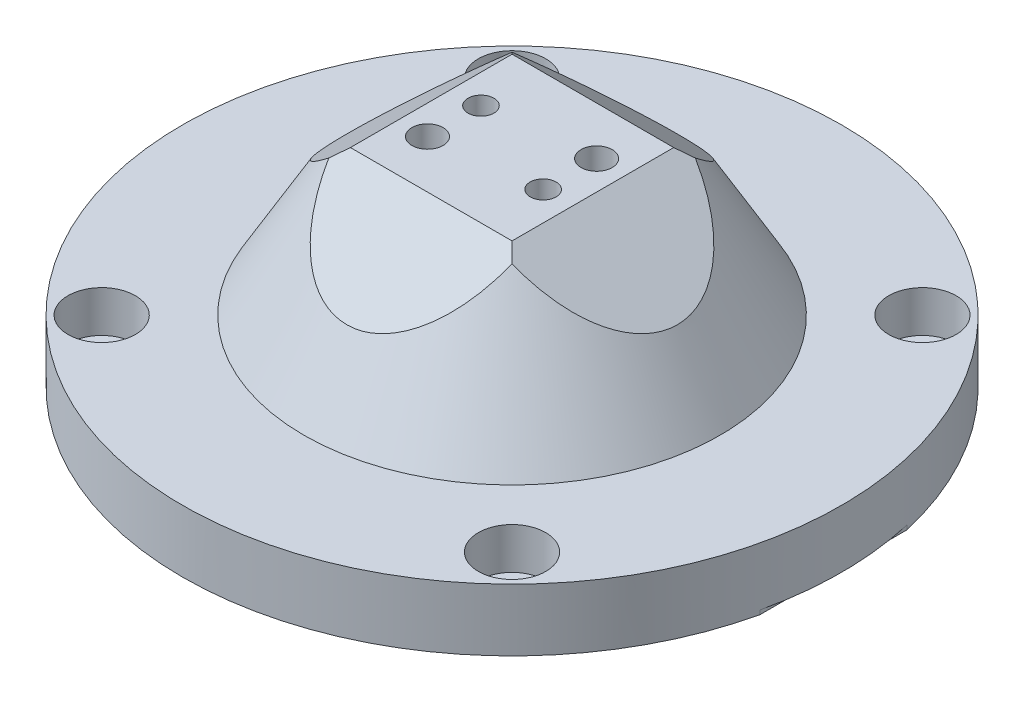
ISO-10303-21;
HEADER;
FILE_DESCRIPTION(('STEP AP214'),'2;1');
FILE_NAME('part.step','',(''),(''),'','','');
FILE_SCHEMA(('AUTOMOTIVE_DESIGN { 1 0 10303 214 1 1 1 1 }'));
ENDSEC;
DATA;
#1=APPLICATION_CONTEXT('core data for automotive mechanical design processes');
#2=APPLICATION_PROTOCOL_DEFINITION('international standard','automotive_design',2000,#1);
#3=PRODUCT_CONTEXT('',#1,'mechanical');
#4=PRODUCT('Part','Part','',(#3));
#5=PRODUCT_RELATED_PRODUCT_CATEGORY('part','',(#4));
#6=PRODUCT_DEFINITION_FORMATION('','',#4);
#7=PRODUCT_DEFINITION_CONTEXT('part definition',#1,'design');
#8=PRODUCT_DEFINITION('design','',#6,#7);
#9=PRODUCT_DEFINITION_SHAPE('','',#8);
#10=(LENGTH_UNIT() NAMED_UNIT(*) SI_UNIT(.MILLI.,.METRE.));
#11=(NAMED_UNIT(*) PLANE_ANGLE_UNIT() SI_UNIT($,.RADIAN.));
#12=(NAMED_UNIT(*) SI_UNIT($,.STERADIAN.) SOLID_ANGLE_UNIT());
#13=UNCERTAINTY_MEASURE_WITH_UNIT(LENGTH_MEASURE(1.E-05),#10,'distance_accuracy_value','');
#14=(GEOMETRIC_REPRESENTATION_CONTEXT(3) GLOBAL_UNCERTAINTY_ASSIGNED_CONTEXT((#13)) GLOBAL_UNIT_ASSIGNED_CONTEXT((#10,
#11,#12)) REPRESENTATION_CONTEXT('',''));
#15=CARTESIAN_POINT('',(0.,0.,0.));
#16=DIRECTION('',(0.,0.,1.));
#17=DIRECTION('',(1.,0.,0.));
#18=AXIS2_PLACEMENT_3D('',#15,#16,#17);
#19=CARTESIAN_POINT('',(-100.965,-12.7,0.));
#20=DIRECTION('',(0.,-1.,0.));
#21=DIRECTION('',(0.,0.,-1.));
#22=AXIS2_PLACEMENT_3D('',#19,#20,#21);
#23=PLANE('',#22);
#24=CARTESIAN_POINT('',(-62.8617928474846,-12.7,62.8617928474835));
#25=DIRECTION('',(0.,1.,0.));
#26=DIRECTION('',(0.,0.,1.));
#27=AXIS2_PLACEMENT_3D('',#24,#25,#26);
#28=CIRCLE('',#27,10.31875);
#29=CARTESIAN_POINT('',(-62.8617928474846,-12.7,73.1805428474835));
#30=VERTEX_POINT('',#29);
#31=EDGE_CURVE('E547',#30,#30,#28,.T.);
#32=ORIENTED_EDGE('',*,*,#31,.F.);
#33=EDGE_LOOP('',(#32));
#34=FACE_BOUND('',#33,.T.);
#35=CARTESIAN_POINT('',(62.8617928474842,-12.7,62.861792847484));
#36=DIRECTION('',(0.,1.,0.));
#37=DIRECTION('',(0.,0.,1.));
#38=AXIS2_PLACEMENT_3D('',#35,#36,#37);
#39=CIRCLE('',#38,10.31875);
#40=CARTESIAN_POINT('',(62.8617928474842,-12.7,73.180542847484));
#41=VERTEX_POINT('',#40);
#42=EDGE_CURVE('E564',#41,#41,#39,.T.);
#43=ORIENTED_EDGE('',*,*,#42,.F.);
#44=EDGE_LOOP('',(#43));
#45=FACE_BOUND('',#44,.T.);
#46=CARTESIAN_POINT('',(0.,-12.7,0.));
#47=DIRECTION('',(0.,-1.,0.));
#48=DIRECTION('',(0.,0.,-1.));
#49=AXIS2_PLACEMENT_3D('',#46,#47,#48);
#50=CIRCLE('',#49,63.7632194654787);
#51=CARTESIAN_POINT('',(0.,-12.7,-63.7632194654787));
#52=VERTEX_POINT('',#51);
#53=EDGE_CURVE('E439',#52,#52,#50,.T.);
#54=ORIENTED_EDGE('',*,*,#53,.T.);
#55=EDGE_LOOP('',(#54));
#56=FACE_BOUND('',#55,.T.);
#57=CARTESIAN_POINT('',(0.,-12.7,0.));
#58=DIRECTION('',(0.,-1.,0.));
#59=DIRECTION('',(0.,0.,-1.));
#60=AXIS2_PLACEMENT_3D('',#57,#58,#59);
#61=CIRCLE('',#60,100.965);
#62=CARTESIAN_POINT('',(0.,-12.7,-100.965));
#63=VERTEX_POINT('',#62);
#64=EDGE_CURVE('E447',#63,#63,#61,.T.);
#65=ORIENTED_EDGE('',*,*,#64,.F.);
#66=EDGE_LOOP('',(#65));
#67=FACE_BOUND('',#66,.T.);
#68=CARTESIAN_POINT('',(-62.8617928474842,-12.7,-62.861792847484));
#69=DIRECTION('',(0.,1.,0.));
#70=DIRECTION('',(0.,0.,1.));
#71=AXIS2_PLACEMENT_3D('',#68,#69,#70);
#72=CIRCLE('',#71,10.31875);
#73=CARTESIAN_POINT('',(-62.8617928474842,-12.7,-52.543042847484));
#74=VERTEX_POINT('',#73);
#75=EDGE_CURVE('E595',#74,#74,#72,.T.);
#76=ORIENTED_EDGE('',*,*,#75,.F.);
#77=EDGE_LOOP('',(#76));
#78=FACE_BOUND('',#77,.T.);
#79=CARTESIAN_POINT('',(62.8617928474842,-12.7,-62.861792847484));
#80=DIRECTION('',(0.,1.,0.));
#81=DIRECTION('',(0.,0.,1.));
#82=AXIS2_PLACEMENT_3D('',#79,#80,#81);
#83=CIRCLE('',#82,10.31875);
#84=CARTESIAN_POINT('',(62.8617928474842,-12.7,-52.543042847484));
#85=VERTEX_POINT('',#84);
#86=EDGE_CURVE('E577',#85,#85,#83,.T.);
#87=ORIENTED_EDGE('',*,*,#86,.F.);
#88=EDGE_LOOP('',(#87));
#89=FACE_BOUND('',#88,.T.);
#90=ADVANCED_FACE('F299',(#34,#45,#56,#67,#78,#89),#23,.F.);
#91=CARTESIAN_POINT('',(0.,-31.75,0.));
#92=DIRECTION('',(0.,1.,0.));
#93=DIRECTION('',(0.,0.,1.));
#94=AXIS2_PLACEMENT_3D('',#91,#92,#93);
#95=PLANE('',#94);
#96=CARTESIAN_POINT('',(-88.9,-31.75,0.));
#97=DIRECTION('',(0.,-1.,0.));
#98=DIRECTION('',(0.,0.,-1.));
#99=AXIS2_PLACEMENT_3D('',#96,#97,#98);
#100=CIRCLE('',#99,3.1877);
#101=CARTESIAN_POINT('',(-88.9,-31.75,-3.18770000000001));
#102=VERTEX_POINT('',#101);
#103=EDGE_CURVE('E628',#102,#102,#100,.T.);
#104=ORIENTED_EDGE('',*,*,#103,.F.);
#105=EDGE_LOOP('',(#104));
#106=FACE_BOUND('',#105,.T.);
#107=CARTESIAN_POINT('',(-62.8617928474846,-31.75,62.8617928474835));
#108=DIRECTION('',(0.,1.,0.));
#109=DIRECTION('',(0.,0.,1.));
#110=AXIS2_PLACEMENT_3D('',#107,#108,#109);
#111=CIRCLE('',#110,6.74623999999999);
#112=CARTESIAN_POINT('',(-62.8617928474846,-31.75,69.6080328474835));
#113=VERTEX_POINT('',#112);
#114=EDGE_CURVE('E559',#113,#113,#111,.T.);
#115=ORIENTED_EDGE('',*,*,#114,.T.);
#116=EDGE_LOOP('',(#115));
#117=FACE_BOUND('',#116,.T.);
#118=CARTESIAN_POINT('',(62.8617928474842,-31.75,62.861792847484));
#119=DIRECTION('',(0.,1.,0.));
#120=DIRECTION('',(0.,0.,1.));
#121=AXIS2_PLACEMENT_3D('',#118,#119,#120);
#122=CIRCLE('',#121,6.74624);
#123=CARTESIAN_POINT('',(62.8617928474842,-31.75,69.608032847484));
#124=VERTEX_POINT('',#123);
#125=EDGE_CURVE('E571',#124,#124,#122,.T.);
#126=ORIENTED_EDGE('',*,*,#125,.T.);
#127=EDGE_LOOP('',(#126));
#128=FACE_BOUND('',#127,.T.);
#129=CARTESIAN_POINT('',(62.8617928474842,-31.75,-62.861792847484));
#130=DIRECTION('',(0.,1.,0.));
#131=DIRECTION('',(0.,0.,1.));
#132=AXIS2_PLACEMENT_3D('',#129,#130,#131);
#133=CIRCLE('',#132,6.74624);
#134=CARTESIAN_POINT('',(62.8617928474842,-31.75,-56.115552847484));
#135=VERTEX_POINT('',#134);
#136=EDGE_CURVE('E590',#135,#135,#133,.T.);
#137=ORIENTED_EDGE('',*,*,#136,.T.);
#138=EDGE_LOOP('',(#137));
#139=FACE_BOUND('',#138,.T.);
#140=CARTESIAN_POINT('',(-62.8617928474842,-31.75,-62.861792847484));
#141=DIRECTION('',(0.,1.,0.));
#142=DIRECTION('',(0.,0.,1.));
#143=AXIS2_PLACEMENT_3D('',#140,#141,#142);
#144=CIRCLE('',#143,6.74623999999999);
#145=CARTESIAN_POINT('',(-62.8617928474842,-31.75,-56.115552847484));
#146=VERTEX_POINT('',#145);
#147=EDGE_CURVE('E428',#146,#146,#144,.T.);
#148=ORIENTED_EDGE('',*,*,#147,.T.);
#149=EDGE_LOOP('',(#148));
#150=FACE_BOUND('',#149,.T.);
#151=CARTESIAN_POINT('',(0.,-31.75,0.));
#152=DIRECTION('',(0.,-1.,0.));
#153=DIRECTION('',(0.,0.,-1.));
#154=AXIS2_PLACEMENT_3D('',#151,#152,#153);
#155=CIRCLE('',#154,4.7752);
#156=CARTESIAN_POINT('',(0.,-31.75,-4.7752));
#157=VERTEX_POINT('',#156);
#158=EDGE_CURVE('E434',#157,#157,#155,.T.);
#159=ORIENTED_EDGE('',*,*,#158,.F.);
#160=EDGE_LOOP('',(#159));
#161=FACE_BOUND('',#160,.T.);
#162=CARTESIAN_POINT('',(0.,-31.75,0.));
#163=DIRECTION('',(0.,-1.,0.));
#164=DIRECTION('',(0.,0.,-1.));
#165=AXIS2_PLACEMENT_3D('',#162,#163,#164);
#166=CIRCLE('',#165,100.965);
#167=CARTESIAN_POINT('',(-98.425,-31.75,-22.5044573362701));
#168=VERTEX_POINT('',#167);
#169=CARTESIAN_POINT('',(98.425,-31.75,-22.5044573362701));
#170=VERTEX_POINT('',#169);
#171=EDGE_CURVE('E451',#168,#170,#166,.T.);
#172=ORIENTED_EDGE('',*,*,#171,.T.);
#173=DIRECTION('',(0.,0.,-1.));
#174=VECTOR('',#173,1.);
#175=CARTESIAN_POINT('',(98.425,-31.75,22.5044573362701));
#176=LINE('',#175,#174);
#177=CARTESIAN_POINT('',(98.425,-31.75,22.5044573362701));
#178=VERTEX_POINT('',#177);
#179=EDGE_CURVE('E381',#178,#170,#176,.T.);
#180=ORIENTED_EDGE('',*,*,#179,.F.);
#181=CARTESIAN_POINT('',(-98.425,-31.75,22.5044573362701));
#182=VERTEX_POINT('',#181);
#183=EDGE_CURVE('E394',#178,#182,#166,.T.);
#184=ORIENTED_EDGE('',*,*,#183,.T.);
#185=DIRECTION('',(0.,0.,1.));
#186=VECTOR('',#185,1.);
#187=CARTESIAN_POINT('',(-98.425,-31.75,-22.5044573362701));
#188=LINE('',#187,#186);
#189=EDGE_CURVE('E400',#168,#182,#188,.T.);
#190=ORIENTED_EDGE('',*,*,#189,.F.);
#191=EDGE_LOOP('',(#172,#180,#184,#190));
#192=FACE_BOUND('',#191,.T.);
#193=ADVANCED_FACE('F301',(#106,#117,#128,#139,#150,#161,#192),#95,.F.);
#194=CARTESIAN_POINT('',(0.,-31.75,0.));
#195=DIRECTION('',(0.,-1.,0.));
#196=DIRECTION('',(0.,0.,-1.));
#197=AXIS2_PLACEMENT_3D('',#194,#195,#196);
#198=CYLINDRICAL_SURFACE('',#197,100.965);
#199=CARTESIAN_POINT('',(0.,-30.48,0.));
#200=DIRECTION('',(0.,-1.,0.));
#201=DIRECTION('',(0.,0.,-1.));
#202=AXIS2_PLACEMENT_3D('',#199,#200,#201);
#203=CIRCLE('',#202,100.965);
#204=CARTESIAN_POINT('',(98.425,-30.48,-22.5044573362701));
#205=VERTEX_POINT('',#204);
#206=CARTESIAN_POINT('',(98.425,-30.48,22.5044573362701));
#207=VERTEX_POINT('',#206);
#208=EDGE_CURVE('E375',#205,#207,#203,.T.);
#209=ORIENTED_EDGE('',*,*,#208,.F.);
#210=DIRECTION('',(0.,-1.,0.));
#211=VECTOR('',#210,1.);
#212=CARTESIAN_POINT('',(98.425,-30.48,-22.5044573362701));
#213=LINE('',#212,#211);
#214=EDGE_CURVE('E387',#205,#170,#213,.T.);
#215=ORIENTED_EDGE('',*,*,#214,.T.);
#216=ORIENTED_EDGE('',*,*,#171,.F.);
#217=DIRECTION('',(0.,-1.,0.));
#218=VECTOR('',#217,1.);
#219=CARTESIAN_POINT('',(-98.425,-30.48,-22.5044573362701));
#220=LINE('',#219,#218);
#221=CARTESIAN_POINT('',(-98.425,-30.48,-22.5044573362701));
#222=VERTEX_POINT('',#221);
#223=EDGE_CURVE('E410',#222,#168,#220,.T.);
#224=ORIENTED_EDGE('',*,*,#223,.F.);
#225=CARTESIAN_POINT('',(0.,-30.48,0.));
#226=DIRECTION('',(0.,-1.,0.));
#227=DIRECTION('',(0.,0.,-1.));
#228=AXIS2_PLACEMENT_3D('',#225,#226,#227);
#229=CIRCLE('',#228,100.965);
#230=CARTESIAN_POINT('',(-98.425,-30.48,22.5044573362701));
#231=VERTEX_POINT('',#230);
#232=EDGE_CURVE('E403',#231,#222,#229,.T.);
#233=ORIENTED_EDGE('',*,*,#232,.F.);
#234=DIRECTION('',(0.,-1.,0.));
#235=VECTOR('',#234,1.);
#236=CARTESIAN_POINT('',(-98.425,-30.48,22.5044573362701));
#237=LINE('',#236,#235);
#238=EDGE_CURVE('E616',#231,#182,#237,.T.);
#239=ORIENTED_EDGE('',*,*,#238,.T.);
#240=ORIENTED_EDGE('',*,*,#183,.F.);
#241=DIRECTION('',(0.,-1.,0.));
#242=VECTOR('',#241,1.);
#243=CARTESIAN_POINT('',(98.425,-30.48,22.5044573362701));
#244=LINE('',#243,#242);
#245=EDGE_CURVE('E385',#207,#178,#244,.T.);
#246=ORIENTED_EDGE('',*,*,#245,.F.);
#247=EDGE_LOOP('',(#209,#215,#216,#224,#233,#239,#240,#246));
#248=FACE_BOUND('',#247,.T.);
#249=ORIENTED_EDGE('',*,*,#64,.T.);
#250=EDGE_LOOP('',(#249));
#251=FACE_BOUND('',#250,.T.);
#252=ADVANCED_FACE('F391',(#248,#251),#198,.T.);
#253=CARTESIAN_POINT('',(0.,31.75,0.));
#254=DIRECTION('',(0.,-1.,0.));
#255=DIRECTION('',(0.,0.,-1.));
#256=AXIS2_PLACEMENT_3D('',#253,#254,#255);
#257=CONICAL_SURFACE('',#256,38.1,0.523598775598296);
#258=ORIENTED_EDGE('',*,*,#53,.F.);
#259=EDGE_LOOP('',(#258));
#260=FACE_BOUND('',#259,.T.);
#261=CARTESIAN_POINT('',(-16.5234542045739,38.6654780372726,0.));
#262=DIRECTION('',(0.642787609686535,-0.766044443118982,0.));
#263=DIRECTION('',(-0.766044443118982,-0.642787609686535,0.));
#264=AXIS2_PLACEMENT_3D('',#261,#262,#263);
#265=ELLIPSE('',#264,44.5239792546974,29.8376703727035);
#266=CARTESIAN_POINT('',(-28.0744603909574,28.9730330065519,28.0744603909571));
#267=VERTEX_POINT('',#266);
#268=CARTESIAN_POINT('',(-28.0744603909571,28.9730330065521,-28.0744603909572));
#269=VERTEX_POINT('',#268);
#270=EDGE_CURVE('E467',#267,#269,#265,.T.);
#271=ORIENTED_EDGE('',*,*,#270,.T.);
#272=CARTESIAN_POINT('',(0.,38.6654780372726,-16.5234542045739));
#273=DIRECTION('',(0.,-0.766044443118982,0.642787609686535));
#274=DIRECTION('',(0.,-0.642787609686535,-0.766044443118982));
#275=AXIS2_PLACEMENT_3D('',#272,#273,#274);
#276=ELLIPSE('',#275,44.5239792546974,29.8376703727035);
#277=CARTESIAN_POINT('',(28.0744603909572,28.973033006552,-28.0744603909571));
#278=VERTEX_POINT('',#277);
#279=EDGE_CURVE('E488',#269,#278,#276,.T.);
#280=ORIENTED_EDGE('',*,*,#279,.T.);
#281=CARTESIAN_POINT('',(16.5234542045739,38.6654780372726,0.));
#282=DIRECTION('',(-0.642787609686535,-0.766044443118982,0.));
#283=DIRECTION('',(0.766044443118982,-0.642787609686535,0.));
#284=AXIS2_PLACEMENT_3D('',#281,#282,#283);
#285=ELLIPSE('',#284,44.5239792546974,29.8376703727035);
#286=CARTESIAN_POINT('',(28.0744603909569,28.9730330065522,28.0744603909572));
#287=VERTEX_POINT('',#286);
#288=EDGE_CURVE('E495',#278,#287,#285,.T.);
#289=ORIENTED_EDGE('',*,*,#288,.T.);
#290=CARTESIAN_POINT('',(-1.73073996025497E-13,38.6654780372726,16.5234542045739));
#291=DIRECTION('',(0.,-0.766044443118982,-0.642787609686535));
#292=DIRECTION('',(0.,-0.642787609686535,0.766044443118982));
#293=AXIS2_PLACEMENT_3D('',#290,#291,#292);
#294=ELLIPSE('',#293,44.5239792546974,29.8376703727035);
#295=EDGE_CURVE('E483',#287,#267,#294,.T.);
#296=ORIENTED_EDGE('',*,*,#295,.T.);
#297=EDGE_LOOP('',(#271,#280,#289,#296));
#298=FACE_BOUND('',#297,.T.);
#299=ADVANCED_FACE('F646',(#260,#298),#257,.T.);
#300=CARTESIAN_POINT('',(-38.1,31.75,0.));
#301=DIRECTION('',(0.,-1.,0.));
#302=DIRECTION('',(0.,0.,-1.));
#303=AXIS2_PLACEMENT_3D('',#300,#301,#302);
#304=PLANE('',#303);
#305=CARTESIAN_POINT('',(15.875,31.75,-10.033));
#306=DIRECTION('',(0.,1.,0.));
#307=DIRECTION('',(0.,0.,1.));
#308=AXIS2_PLACEMENT_3D('',#305,#306,#307);
#309=CIRCLE('',#308,4.7752);
#310=CARTESIAN_POINT('',(15.875,31.75,-5.2578));
#311=VERTEX_POINT('',#310);
#312=EDGE_CURVE('E499',#311,#311,#309,.T.);
#313=ORIENTED_EDGE('',*,*,#312,.F.);
#314=EDGE_LOOP('',(#313));
#315=FACE_BOUND('',#314,.T.);
#316=CARTESIAN_POINT('',(-15.875,31.75,10.033));
#317=DIRECTION('',(0.,1.,0.));
#318=DIRECTION('',(0.,0.,1.));
#319=AXIS2_PLACEMENT_3D('',#316,#317,#318);
#320=CIRCLE('',#319,4.7752);
#321=CARTESIAN_POINT('',(-15.875,31.75,14.8082));
#322=VERTEX_POINT('',#321);
#323=EDGE_CURVE('E504',#322,#322,#320,.T.);
#324=ORIENTED_EDGE('',*,*,#323,.F.);
#325=EDGE_LOOP('',(#324));
#326=FACE_BOUND('',#325,.T.);
#327=CARTESIAN_POINT('',(-15.875,31.75,-6.35));
#328=DIRECTION('',(0.,1.,0.));
#329=DIRECTION('',(0.,0.,1.));
#330=AXIS2_PLACEMENT_3D('',#327,#328,#329);
#331=CIRCLE('',#330,3.96875);
#332=CARTESIAN_POINT('',(-15.875,31.75,-2.38125));
#333=VERTEX_POINT('',#332);
#334=EDGE_CURVE('E512',#333,#333,#331,.T.);
#335=ORIENTED_EDGE('',*,*,#334,.F.);
#336=EDGE_LOOP('',(#335));
#337=FACE_BOUND('',#336,.T.);
#338=CARTESIAN_POINT('',(15.875,31.75,6.34999999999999));
#339=DIRECTION('',(0.,1.,0.));
#340=DIRECTION('',(0.,0.,1.));
#341=AXIS2_PLACEMENT_3D('',#338,#339,#340);
#342=CIRCLE('',#341,3.96875);
#343=CARTESIAN_POINT('',(15.875,31.75,10.31875));
#344=VERTEX_POINT('',#343);
#345=EDGE_CURVE('E531',#344,#344,#342,.T.);
#346=ORIENTED_EDGE('',*,*,#345,.F.);
#347=EDGE_LOOP('',(#346));
#348=FACE_BOUND('',#347,.T.);
#349=DIRECTION('',(0.,0.,-1.));
#350=VECTOR('',#349,1.);
#351=CARTESIAN_POINT('',(24.765,31.75,100.965));
#352=LINE('',#351,#350);
#353=CARTESIAN_POINT('',(24.765,31.75,24.7650000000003));
#354=VERTEX_POINT('',#353);
#355=CARTESIAN_POINT('',(24.765,31.75,-24.7650000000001));
#356=VERTEX_POINT('',#355);
#357=EDGE_CURVE('E479',#354,#356,#352,.T.);
#358=ORIENTED_EDGE('',*,*,#357,.T.);
#359=DIRECTION('',(-1.,0.,0.));
#360=VECTOR('',#359,1.);
#361=CARTESIAN_POINT('',(100.965,31.75,-24.7649999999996));
#362=LINE('',#361,#360);
#363=CARTESIAN_POINT('',(-24.7650000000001,31.75,-24.7650000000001));
#364=VERTEX_POINT('',#363);
#365=EDGE_CURVE('E477',#356,#364,#362,.T.);
#366=ORIENTED_EDGE('',*,*,#365,.T.);
#367=DIRECTION('',(0.,0.,1.));
#368=VECTOR('',#367,1.);
#369=CARTESIAN_POINT('',(-24.765,31.75,0.));
#370=LINE('',#369,#368);
#371=CARTESIAN_POINT('',(-24.765,31.75,24.7649999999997));
#372=VERTEX_POINT('',#371);
#373=EDGE_CURVE('E455',#364,#372,#370,.T.);
#374=ORIENTED_EDGE('',*,*,#373,.T.);
#375=DIRECTION('',(1.,0.,0.));
#376=VECTOR('',#375,1.);
#377=CARTESIAN_POINT('',(-100.965000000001,31.75,24.7649999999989));
#378=LINE('',#377,#376);
#379=EDGE_CURVE('E475',#372,#354,#378,.T.);
#380=ORIENTED_EDGE('',*,*,#379,.T.);
#381=EDGE_LOOP('',(#358,#366,#374,#380));
#382=FACE_BOUND('',#381,.T.);
#383=ADVANCED_FACE('F474',(#315,#326,#337,#348,#382),#304,.F.);
#384=CARTESIAN_POINT('',(0.,-24.13,0.));
#385=DIRECTION('',(0.,-1.,0.));
#386=DIRECTION('',(0.,0.,-1.));
#387=AXIS2_PLACEMENT_3D('',#384,#385,#386);
#388=CYLINDRICAL_SURFACE('',#387,4.7752);
#389=CARTESIAN_POINT('',(0.,-24.13,0.));
#390=DIRECTION('',(0.,-1.,0.));
#391=DIRECTION('',(0.,0.,-1.));
#392=AXIS2_PLACEMENT_3D('',#389,#390,#391);
#393=CIRCLE('',#392,4.7752);
#394=CARTESIAN_POINT('',(0.,-24.13,-4.7752));
#395=VERTEX_POINT('',#394);
#396=EDGE_CURVE('E435',#395,#395,#393,.T.);
#397=CARTESIAN_POINT('',(0.,-24.13,-4.7752));
#398=CARTESIAN_POINT('',(0.,-24.209375,-4.7752));
#399=CARTESIAN_POINT('',(0.,-24.28875,-4.7752));
#400=CARTESIAN_POINT('',(0.,-24.4475,-4.7752));
#401=CARTESIAN_POINT('',(0.,-24.526875,-4.7752));
#402=CARTESIAN_POINT('',(0.,-24.685625,-4.7752));
#403=CARTESIAN_POINT('',(0.,-24.765,-4.7752));
#404=CARTESIAN_POINT('',(0.,-24.92375,-4.7752));
#405=CARTESIAN_POINT('',(0.,-25.003125,-4.7752));
#406=CARTESIAN_POINT('',(0.,-25.161875,-4.7752));
#407=CARTESIAN_POINT('',(0.,-25.24125,-4.7752));
#408=CARTESIAN_POINT('',(0.,-25.4,-4.7752));
#409=CARTESIAN_POINT('',(0.,-25.479375,-4.7752));
#410=CARTESIAN_POINT('',(0.,-25.638125,-4.7752));
#411=CARTESIAN_POINT('',(0.,-25.7175,-4.7752));
#412=CARTESIAN_POINT('',(0.,-25.87625,-4.7752));
#413=CARTESIAN_POINT('',(0.,-25.955625,-4.7752));
#414=CARTESIAN_POINT('',(0.,-26.114375,-4.7752));
#415=CARTESIAN_POINT('',(0.,-26.19375,-4.7752));
#416=CARTESIAN_POINT('',(0.,-26.3525,-4.7752));
#417=CARTESIAN_POINT('',(0.,-26.431875,-4.7752));
#418=CARTESIAN_POINT('',(0.,-26.590625,-4.7752));
#419=CARTESIAN_POINT('',(0.,-26.67,-4.7752));
#420=CARTESIAN_POINT('',(0.,-26.82875,-4.7752));
#421=CARTESIAN_POINT('',(0.,-26.908125,-4.7752));
#422=CARTESIAN_POINT('',(0.,-27.066875,-4.7752));
#423=CARTESIAN_POINT('',(0.,-27.14625,-4.7752));
#424=CARTESIAN_POINT('',(0.,-27.305,-4.7752));
#425=CARTESIAN_POINT('',(0.,-27.384375,-4.7752));
#426=CARTESIAN_POINT('',(0.,-27.543125,-4.7752));
#427=CARTESIAN_POINT('',(0.,-27.6225,-4.7752));
#428=CARTESIAN_POINT('',(0.,-27.78125,-4.7752));
#429=CARTESIAN_POINT('',(0.,-27.860625,-4.7752));
#430=CARTESIAN_POINT('',(0.,-28.019375,-4.7752));
#431=CARTESIAN_POINT('',(0.,-28.09875,-4.7752));
#432=CARTESIAN_POINT('',(0.,-28.2575,-4.7752));
#433=CARTESIAN_POINT('',(0.,-28.336875,-4.7752));
#434=CARTESIAN_POINT('',(0.,-28.495625,-4.7752));
#435=CARTESIAN_POINT('',(0.,-28.575,-4.7752));
#436=CARTESIAN_POINT('',(0.,-28.73375,-4.7752));
#437=CARTESIAN_POINT('',(0.,-28.813125,-4.7752));
#438=CARTESIAN_POINT('',(0.,-28.971875,-4.7752));
#439=CARTESIAN_POINT('',(0.,-29.05125,-4.7752));
#440=CARTESIAN_POINT('',(0.,-29.21,-4.7752));
#441=CARTESIAN_POINT('',(0.,-29.289375,-4.7752));
#442=CARTESIAN_POINT('',(0.,-29.448125,-4.7752));
#443=CARTESIAN_POINT('',(0.,-29.5275,-4.7752));
#444=CARTESIAN_POINT('',(0.,-29.68625,-4.7752));
#445=CARTESIAN_POINT('',(0.,-29.765625,-4.7752));
#446=CARTESIAN_POINT('',(0.,-29.924375,-4.7752));
#447=CARTESIAN_POINT('',(0.,-30.00375,-4.7752));
#448=CARTESIAN_POINT('',(0.,-30.1625,-4.7752));
#449=CARTESIAN_POINT('',(0.,-30.241875,-4.7752));
#450=CARTESIAN_POINT('',(0.,-30.400625,-4.7752));
#451=CARTESIAN_POINT('',(0.,-30.48,-4.7752));
#452=CARTESIAN_POINT('',(0.,-30.63875,-4.7752));
#453=CARTESIAN_POINT('',(0.,-30.718125,-4.7752));
#454=CARTESIAN_POINT('',(0.,-30.876875,-4.7752));
#455=CARTESIAN_POINT('',(0.,-30.95625,-4.7752));
#456=CARTESIAN_POINT('',(0.,-31.115,-4.7752));
#457=CARTESIAN_POINT('',(0.,-31.194375,-4.7752));
#458=CARTESIAN_POINT('',(0.,-31.353125,-4.7752));
#459=CARTESIAN_POINT('',(0.,-31.4325,-4.7752));
#460=CARTESIAN_POINT('',(0.,-31.59125,-4.7752));
#461=CARTESIAN_POINT('',(0.,-31.670625,-4.7752));
#462=CARTESIAN_POINT('',(0.,-31.75,-4.7752));
#463=B_SPLINE_CURVE_WITH_KNOTS('',3,(#397,#398,#399,#400,#401,#402,#403,#404,#405,#406,#407,
#408,#409,#410,#411,#412,#413,#414,#415,#416,#417,#418,#419,#420,#421,#422,#423,#424,#425,#426,
#427,#428,#429,#430,#431,#432,#433,#434,#435,#436,#437,#438,#439,#440,#441,#442,#443,#444,#445,
#446,#447,#448,#449,#450,#451,#452,#453,#454,#455,#456,#457,#458,#459,#460,#461,#462),
.UNSPECIFIED.,.F.,.F.,(4,2,2,2,2,2,2,2,2,2,2,2,2,2,2,2,2,2,2,2,2,2,2,2,2,2,2,2,2,2,2,2,4),(0.,
0.238124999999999,0.476249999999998,0.714375,0.952499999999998,1.190625,1.42875,1.666875,1.905,
2.143125,2.38125,2.619375,2.8575,3.095625,3.33375,3.571875,3.81,4.048125,4.28625,4.524375,
4.7625,5.000625,5.23875,5.476875,5.715,5.953125,6.19125,6.429375,6.6675,6.905625,7.14375,
7.381875,7.61999999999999),.UNSPECIFIED.);
#464=EDGE_CURVE('BSEAM677',#395,#157,#463,.T.);
#465=ORIENTED_EDGE('',*,*,#396,.F.);
#466=ORIENTED_EDGE('',*,*,#158,.T.);
#467=ORIENTED_EDGE('',*,*,#464,.T.);
#468=ORIENTED_EDGE('',*,*,#464,.F.);
#469=EDGE_LOOP('',(#465,#467,#466,#468));
#470=FACE_BOUND('',#469,.T.);
#471=ADVANCED_FACE('F677',(#470),#388,.F.);
#472=CARTESIAN_POINT('',(0.,-24.13,0.));
#473=DIRECTION('',(0.,-1.,0.));
#474=DIRECTION('',(0.,0.,-1.));
#475=AXIS2_PLACEMENT_3D('',#472,#473,#474);
#476=PLANE('',#475);
#477=CARTESIAN_POINT('',(0.,-24.13,0.));
#478=DIRECTION('',(0.,-1.,0.));
#479=DIRECTION('',(0.,0.,-1.));
#480=AXIS2_PLACEMENT_3D('',#477,#478,#479);
#481=CIRCLE('',#480,2.0193);
#482=CARTESIAN_POINT('',(0.,-24.13,-2.0193));
#483=VERTEX_POINT('',#482);
#484=EDGE_CURVE('E421',#483,#483,#481,.T.);
#485=ORIENTED_EDGE('',*,*,#484,.F.);
#486=EDGE_LOOP('',(#485));
#487=FACE_BOUND('',#486,.T.);
#488=ORIENTED_EDGE('',*,*,#396,.T.);
#489=EDGE_LOOP('',(#488));
#490=FACE_BOUND('',#489,.T.);
#491=ADVANCED_FACE('F730',(#487,#490),#476,.T.);
#492=CARTESIAN_POINT('',(0.,-12.0904,0.));
#493=DIRECTION('',(0.,-1.,0.));
#494=DIRECTION('',(0.,0.,-1.));
#495=AXIS2_PLACEMENT_3D('',#492,#493,#494);
#496=CONICAL_SURFACE('',#495,2.0193,1.02974425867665);
#497=CARTESIAN_POINT('',(0.,-10.8770821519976,0.));
#498=VERTEX_POINT('',#497);
#499=VERTEX_LOOP('',#498);
#500=FACE_BOUND('',#499,.T.);
#501=CARTESIAN_POINT('',(0.,-12.0904,0.));
#502=DIRECTION('',(0.,-1.,0.));
#503=DIRECTION('',(0.,0.,-1.));
#504=AXIS2_PLACEMENT_3D('',#501,#502,#503);
#505=CIRCLE('',#504,2.0193);
#506=CARTESIAN_POINT('',(0.,-12.0904,-2.0193));
#507=VERTEX_POINT('',#506);
#508=EDGE_CURVE('E427',#507,#507,#505,.T.);
#509=ORIENTED_EDGE('',*,*,#508,.T.);
#510=EDGE_LOOP('',(#509));
#511=FACE_BOUND('',#510,.T.);
#512=ADVANCED_FACE('F726',(#500,#511),#496,.F.);
#513=CARTESIAN_POINT('',(0.,-24.13,0.));
#514=DIRECTION('',(0.,-1.,0.));
#515=DIRECTION('',(0.,0.,-1.));
#516=AXIS2_PLACEMENT_3D('',#513,#514,#515);
#517=CYLINDRICAL_SURFACE('',#516,2.0193);
#518=ORIENTED_EDGE('',*,*,#508,.F.);
#519=EDGE_LOOP('',(#518));
#520=FACE_BOUND('',#519,.T.);
#521=ORIENTED_EDGE('',*,*,#484,.T.);
#522=EDGE_LOOP('',(#521));
#523=FACE_BOUND('',#522,.T.);
#524=ADVANCED_FACE('F722',(#520,#523),#517,.F.);
#525=CARTESIAN_POINT('',(-62.8617928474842,-12.7,-62.861792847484));
#526=DIRECTION('',(0.,1.,0.));
#527=DIRECTION('',(0.,0.,1.));
#528=AXIS2_PLACEMENT_3D('',#525,#526,#527);
#529=CYLINDRICAL_SURFACE('',#528,6.74624);
#530=ORIENTED_EDGE('',*,*,#147,.F.);
#531=EDGE_LOOP('',(#530));
#532=FACE_BOUND('',#531,.T.);
#533=CARTESIAN_POINT('',(-62.8617928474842,-25.4,-62.861792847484));
#534=DIRECTION('',(0.,1.,0.));
#535=DIRECTION('',(0.,0.,1.));
#536=AXIS2_PLACEMENT_3D('',#533,#534,#535);
#537=CIRCLE('',#536,6.74624);
#538=CARTESIAN_POINT('',(-62.8617928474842,-25.4,-56.115552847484));
#539=VERTEX_POINT('',#538);
#540=EDGE_CURVE('E1190',#539,#539,#537,.T.);
#541=ORIENTED_EDGE('',*,*,#540,.T.);
#542=EDGE_LOOP('',(#541));
#543=FACE_BOUND('',#542,.T.);
#544=ADVANCED_FACE('F718',(#532,#543),#529,.F.);
#545=CARTESIAN_POINT('',(-56.1155528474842,-25.4,-62.861792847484));
#546=DIRECTION('',(0.,-1.,0.));
#547=DIRECTION('',(0.,0.,-1.));
#548=AXIS2_PLACEMENT_3D('',#545,#546,#547);
#549=PLANE('',#548);
#550=ORIENTED_EDGE('',*,*,#540,.F.);
#551=EDGE_LOOP('',(#550));
#552=FACE_BOUND('',#551,.T.);
#553=CARTESIAN_POINT('',(-62.8617928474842,-25.4,-62.861792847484));
#554=DIRECTION('',(0.,1.,0.));
#555=DIRECTION('',(0.,0.,1.));
#556=AXIS2_PLACEMENT_3D('',#553,#554,#555);
#557=CIRCLE('',#556,10.31875);
#558=CARTESIAN_POINT('',(-62.8617928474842,-25.4,-52.543042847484));
#559=VERTEX_POINT('',#558);
#560=EDGE_CURVE('E1193',#559,#559,#557,.T.);
#561=ORIENTED_EDGE('',*,*,#560,.T.);
#562=EDGE_LOOP('',(#561));
#563=FACE_BOUND('',#562,.T.);
#564=ADVANCED_FACE('F714',(#552,#563),#549,.F.);
#565=CARTESIAN_POINT('',(-62.8617928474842,-12.7,-62.861792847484));
#566=DIRECTION('',(0.,1.,0.));
#567=DIRECTION('',(0.,0.,1.));
#568=AXIS2_PLACEMENT_3D('',#565,#566,#567);
#569=CYLINDRICAL_SURFACE('',#568,10.31875);
#570=ORIENTED_EDGE('',*,*,#560,.F.);
#571=EDGE_LOOP('',(#570));
#572=FACE_BOUND('',#571,.T.);
#573=ORIENTED_EDGE('',*,*,#75,.T.);
#574=EDGE_LOOP('',(#573));
#575=FACE_BOUND('',#574,.T.);
#576=ADVANCED_FACE('F710',(#572,#575),#569,.F.);
#577=CARTESIAN_POINT('',(62.8617928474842,-12.7,-62.861792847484));
#578=DIRECTION('',(0.,1.,0.));
#579=DIRECTION('',(0.,0.,1.));
#580=AXIS2_PLACEMENT_3D('',#577,#578,#579);
#581=CYLINDRICAL_SURFACE('',#580,6.74624);
#582=ORIENTED_EDGE('',*,*,#136,.F.);
#583=EDGE_LOOP('',(#582));
#584=FACE_BOUND('',#583,.T.);
#585=CARTESIAN_POINT('',(62.8617928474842,-25.4,-62.861792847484));
#586=DIRECTION('',(0.,1.,0.));
#587=DIRECTION('',(0.,0.,1.));
#588=AXIS2_PLACEMENT_3D('',#585,#586,#587);
#589=CIRCLE('',#588,6.74624);
#590=CARTESIAN_POINT('',(62.8617928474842,-25.4,-56.115552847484));
#591=VERTEX_POINT('',#590);
#592=EDGE_CURVE('E586',#591,#591,#589,.T.);
#593=ORIENTED_EDGE('',*,*,#592,.T.);
#594=EDGE_LOOP('',(#593));
#595=FACE_BOUND('',#594,.T.);
#596=ADVANCED_FACE('F702',(#584,#595),#581,.F.);
#597=CARTESIAN_POINT('',(69.6080328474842,-25.4,-62.861792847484));
#598=DIRECTION('',(0.,-1.,0.));
#599=DIRECTION('',(0.,0.,-1.));
#600=AXIS2_PLACEMENT_3D('',#597,#598,#599);
#601=PLANE('',#600);
#602=ORIENTED_EDGE('',*,*,#592,.F.);
#603=EDGE_LOOP('',(#602));
#604=FACE_BOUND('',#603,.T.);
#605=CARTESIAN_POINT('',(62.8617928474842,-25.4,-62.861792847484));
#606=DIRECTION('',(0.,1.,0.));
#607=DIRECTION('',(0.,0.,1.));
#608=AXIS2_PLACEMENT_3D('',#605,#606,#607);
#609=CIRCLE('',#608,10.31875);
#610=CARTESIAN_POINT('',(62.8617928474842,-25.4,-52.543042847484));
#611=VERTEX_POINT('',#610);
#612=EDGE_CURVE('E582',#611,#611,#609,.T.);
#613=ORIENTED_EDGE('',*,*,#612,.T.);
#614=EDGE_LOOP('',(#613));
#615=FACE_BOUND('',#614,.T.);
#616=ADVANCED_FACE('F692',(#604,#615),#601,.F.);
#617=CARTESIAN_POINT('',(62.8617928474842,-12.7,-62.861792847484));
#618=DIRECTION('',(0.,1.,0.));
#619=DIRECTION('',(0.,0.,1.));
#620=AXIS2_PLACEMENT_3D('',#617,#618,#619);
#621=CYLINDRICAL_SURFACE('',#620,10.31875);
#622=ORIENTED_EDGE('',*,*,#612,.F.);
#623=EDGE_LOOP('',(#622));
#624=FACE_BOUND('',#623,.T.);
#625=ORIENTED_EDGE('',*,*,#86,.T.);
#626=EDGE_LOOP('',(#625));
#627=FACE_BOUND('',#626,.T.);
#628=ADVANCED_FACE('F689',(#624,#627),#621,.F.);
#629=CARTESIAN_POINT('',(62.8617928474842,-12.7,62.861792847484));
#630=DIRECTION('',(0.,1.,0.));
#631=DIRECTION('',(0.,0.,1.));
#632=AXIS2_PLACEMENT_3D('',#629,#630,#631);
#633=CYLINDRICAL_SURFACE('',#632,6.74624);
#634=ORIENTED_EDGE('',*,*,#125,.F.);
#635=EDGE_LOOP('',(#634));
#636=FACE_BOUND('',#635,.T.);
#637=CARTESIAN_POINT('',(62.8617928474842,-25.4,62.861792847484));
#638=DIRECTION('',(0.,1.,0.));
#639=DIRECTION('',(0.,0.,1.));
#640=AXIS2_PLACEMENT_3D('',#637,#638,#639);
#641=CIRCLE('',#640,6.74624);
#642=CARTESIAN_POINT('',(62.8617928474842,-25.4,69.608032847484));
#643=VERTEX_POINT('',#642);
#644=EDGE_CURVE('E578',#643,#643,#641,.T.);
#645=ORIENTED_EDGE('',*,*,#644,.T.);
#646=EDGE_LOOP('',(#645));
#647=FACE_BOUND('',#646,.T.);
#648=ADVANCED_FACE('F691',(#636,#647),#633,.F.);
#649=CARTESIAN_POINT('',(69.6080328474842,-25.4,62.861792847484));
#650=DIRECTION('',(0.,-1.,0.));
#651=DIRECTION('',(0.,0.,-1.));
#652=AXIS2_PLACEMENT_3D('',#649,#650,#651);
#653=PLANE('',#652);
#654=ORIENTED_EDGE('',*,*,#644,.F.);
#655=EDGE_LOOP('',(#654));
#656=FACE_BOUND('',#655,.T.);
#657=CARTESIAN_POINT('',(62.8617928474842,-25.4,62.861792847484));
#658=DIRECTION('',(0.,1.,0.));
#659=DIRECTION('',(0.,0.,1.));
#660=AXIS2_PLACEMENT_3D('',#657,#658,#659);
#661=CIRCLE('',#660,10.31875);
#662=CARTESIAN_POINT('',(62.8617928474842,-25.4,73.180542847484));
#663=VERTEX_POINT('',#662);
#664=EDGE_CURVE('E615',#663,#663,#661,.T.);
#665=ORIENTED_EDGE('',*,*,#664,.T.);
#666=EDGE_LOOP('',(#665));
#667=FACE_BOUND('',#666,.T.);
#668=ADVANCED_FACE('F699',(#656,#667),#653,.F.);
#669=CARTESIAN_POINT('',(62.8617928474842,-12.7,62.861792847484));
#670=DIRECTION('',(0.,1.,0.));
#671=DIRECTION('',(0.,0.,1.));
#672=AXIS2_PLACEMENT_3D('',#669,#670,#671);
#673=CYLINDRICAL_SURFACE('',#672,10.31875);
#674=ORIENTED_EDGE('',*,*,#664,.F.);
#675=EDGE_LOOP('',(#674));
#676=FACE_BOUND('',#675,.T.);
#677=ORIENTED_EDGE('',*,*,#42,.T.);
#678=EDGE_LOOP('',(#677));
#679=FACE_BOUND('',#678,.T.);
#680=ADVANCED_FACE('F785',(#676,#679),#673,.F.);
#681=CARTESIAN_POINT('',(-62.8617928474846,-12.7,62.8617928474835));
#682=DIRECTION('',(0.,1.,0.));
#683=DIRECTION('',(0.,0.,1.));
#684=AXIS2_PLACEMENT_3D('',#681,#682,#683);
#685=CYLINDRICAL_SURFACE('',#684,6.74624);
#686=ORIENTED_EDGE('',*,*,#114,.F.);
#687=EDGE_LOOP('',(#686));
#688=FACE_BOUND('',#687,.T.);
#689=CARTESIAN_POINT('',(-62.8617928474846,-25.4,62.8617928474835));
#690=DIRECTION('',(0.,1.,0.));
#691=DIRECTION('',(0.,0.,1.));
#692=AXIS2_PLACEMENT_3D('',#689,#690,#691);
#693=CIRCLE('',#692,6.74624);
#694=CARTESIAN_POINT('',(-62.8617928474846,-25.4,69.6080328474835));
#695=VERTEX_POINT('',#694);
#696=EDGE_CURVE('E555',#695,#695,#693,.T.);
#697=ORIENTED_EDGE('',*,*,#696,.T.);
#698=EDGE_LOOP('',(#697));
#699=FACE_BOUND('',#698,.T.);
#700=ADVANCED_FACE('F793',(#688,#699),#685,.F.);
#701=CARTESIAN_POINT('',(-56.1155528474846,-25.4,62.8617928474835));
#702=DIRECTION('',(0.,-1.,0.));
#703=DIRECTION('',(0.,0.,-1.));
#704=AXIS2_PLACEMENT_3D('',#701,#702,#703);
#705=PLANE('',#704);
#706=ORIENTED_EDGE('',*,*,#696,.F.);
#707=EDGE_LOOP('',(#706));
#708=FACE_BOUND('',#707,.T.);
#709=CARTESIAN_POINT('',(-62.8617928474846,-25.4,62.8617928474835));
#710=DIRECTION('',(0.,1.,0.));
#711=DIRECTION('',(0.,0.,1.));
#712=AXIS2_PLACEMENT_3D('',#709,#710,#711);
#713=CIRCLE('',#712,10.31875);
#714=CARTESIAN_POINT('',(-62.8617928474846,-25.4,73.1805428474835));
#715=VERTEX_POINT('',#714);
#716=EDGE_CURVE('E551',#715,#715,#713,.T.);
#717=ORIENTED_EDGE('',*,*,#716,.T.);
#718=EDGE_LOOP('',(#717));
#719=FACE_BOUND('',#718,.T.);
#720=ADVANCED_FACE('F802',(#708,#719),#705,.F.);
#721=CARTESIAN_POINT('',(-62.8617928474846,-12.7,62.8617928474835));
#722=DIRECTION('',(0.,1.,0.));
#723=DIRECTION('',(0.,0.,1.));
#724=AXIS2_PLACEMENT_3D('',#721,#722,#723);
#725=CYLINDRICAL_SURFACE('',#724,10.31875);
#726=ORIENTED_EDGE('',*,*,#716,.F.);
#727=EDGE_LOOP('',(#726));
#728=FACE_BOUND('',#727,.T.);
#729=ORIENTED_EDGE('',*,*,#31,.T.);
#730=EDGE_LOOP('',(#729));
#731=FACE_BOUND('',#730,.T.);
#732=ADVANCED_FACE('F811',(#728,#731),#725,.F.);
#733=CARTESIAN_POINT('',(15.875,7.18820000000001,6.34999999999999));
#734=DIRECTION('',(0.,1.,0.));
#735=DIRECTION('',(0.,0.,1.));
#736=AXIS2_PLACEMENT_3D('',#733,#734,#735);
#737=CONICAL_SURFACE('',#736,3.26389999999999,1.02974425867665);
#738=CARTESIAN_POINT('',(15.875,5.22705102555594,6.34999999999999));
#739=VERTEX_POINT('',#738);
#740=VERTEX_LOOP('',#739);
#741=FACE_BOUND('',#740,.T.);
#742=CARTESIAN_POINT('',(15.875,7.18820000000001,6.34999999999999));
#743=DIRECTION('',(0.,1.,0.));
#744=DIRECTION('',(0.,0.,1.));
#745=AXIS2_PLACEMENT_3D('',#742,#743,#744);
#746=CIRCLE('',#745,3.26389999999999);
#747=CARTESIAN_POINT('',(15.875,7.18820000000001,9.61389999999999));
#748=VERTEX_POINT('',#747);
#749=EDGE_CURVE('E543',#748,#748,#746,.T.);
#750=ORIENTED_EDGE('',*,*,#749,.T.);
#751=EDGE_LOOP('',(#750));
#752=FACE_BOUND('',#751,.T.);
#753=ADVANCED_FACE('F820',(#741,#752),#737,.F.);
#754=CARTESIAN_POINT('',(15.875,31.75,6.34999999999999));
#755=DIRECTION('',(0.,1.,0.));
#756=DIRECTION('',(0.,0.,1.));
#757=AXIS2_PLACEMENT_3D('',#754,#755,#756);
#758=CYLINDRICAL_SURFACE('',#757,3.2639);
#759=ORIENTED_EDGE('',*,*,#749,.F.);
#760=EDGE_LOOP('',(#759));
#761=FACE_BOUND('',#760,.T.);
#762=CARTESIAN_POINT('',(15.875,17.4244,6.34999999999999));
#763=DIRECTION('',(0.,1.,0.));
#764=DIRECTION('',(0.,0.,1.));
#765=AXIS2_PLACEMENT_3D('',#762,#763,#764);
#766=CIRCLE('',#765,3.2639);
#767=CARTESIAN_POINT('',(15.875,17.4244,9.61389999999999));
#768=VERTEX_POINT('',#767);
#769=EDGE_CURVE('E539',#768,#768,#766,.T.);
#770=ORIENTED_EDGE('',*,*,#769,.T.);
#771=EDGE_LOOP('',(#770));
#772=FACE_BOUND('',#771,.T.);
#773=ADVANCED_FACE('F829',(#761,#772),#758,.F.);
#774=CARTESIAN_POINT('',(19.1389,17.4244,6.34999999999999));
#775=DIRECTION('',(0.,-1.,0.));
#776=DIRECTION('',(0.,0.,-1.));
#777=AXIS2_PLACEMENT_3D('',#774,#775,#776);
#778=PLANE('',#777);
#779=ORIENTED_EDGE('',*,*,#769,.F.);
#780=EDGE_LOOP('',(#779));
#781=FACE_BOUND('',#780,.T.);
#782=CARTESIAN_POINT('',(15.875,17.4244,6.34999999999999));
#783=DIRECTION('',(0.,1.,0.));
#784=DIRECTION('',(0.,0.,1.));
#785=AXIS2_PLACEMENT_3D('',#782,#783,#784);
#786=CIRCLE('',#785,3.96875);
#787=CARTESIAN_POINT('',(15.875,17.4244,10.31875));
#788=VERTEX_POINT('',#787);
#789=EDGE_CURVE('E535',#788,#788,#786,.T.);
#790=ORIENTED_EDGE('',*,*,#789,.T.);
#791=EDGE_LOOP('',(#790));
#792=FACE_BOUND('',#791,.T.);
#793=ADVANCED_FACE('F838',(#781,#792),#778,.F.);
#794=CARTESIAN_POINT('',(15.875,31.75,6.34999999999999));
#795=DIRECTION('',(0.,1.,0.));
#796=DIRECTION('',(0.,0.,1.));
#797=AXIS2_PLACEMENT_3D('',#794,#795,#796);
#798=CYLINDRICAL_SURFACE('',#797,3.96875);
#799=ORIENTED_EDGE('',*,*,#789,.F.);
#800=EDGE_LOOP('',(#799));
#801=FACE_BOUND('',#800,.T.);
#802=ORIENTED_EDGE('',*,*,#345,.T.);
#803=EDGE_LOOP('',(#802));
#804=FACE_BOUND('',#803,.T.);
#805=ADVANCED_FACE('F847',(#801,#804),#798,.F.);
#806=CARTESIAN_POINT('',(-15.875,7.18820000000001,-6.35));
#807=DIRECTION('',(0.,1.,0.));
#808=DIRECTION('',(0.,0.,1.));
#809=AXIS2_PLACEMENT_3D('',#806,#807,#808);
#810=CONICAL_SURFACE('',#809,3.26389999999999,1.02974425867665);
#811=CARTESIAN_POINT('',(-15.875,5.22705102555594,-6.35));
#812=VERTEX_POINT('',#811);
#813=VERTEX_LOOP('',#812);
#814=FACE_BOUND('',#813,.T.);
#815=CARTESIAN_POINT('',(-15.875,7.18820000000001,-6.35));
#816=DIRECTION('',(0.,1.,0.));
#817=DIRECTION('',(0.,0.,1.));
#818=AXIS2_PLACEMENT_3D('',#815,#816,#817);
#819=CIRCLE('',#818,3.26389999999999);
#820=CARTESIAN_POINT('',(-15.875,7.18820000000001,-3.08610000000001));
#821=VERTEX_POINT('',#820);
#822=EDGE_CURVE('E527',#821,#821,#819,.T.);
#823=ORIENTED_EDGE('',*,*,#822,.T.);
#824=EDGE_LOOP('',(#823));
#825=FACE_BOUND('',#824,.T.);
#826=ADVANCED_FACE('F856',(#814,#825),#810,.F.);
#827=CARTESIAN_POINT('',(-15.875,31.75,-6.35));
#828=DIRECTION('',(0.,1.,0.));
#829=DIRECTION('',(0.,0.,1.));
#830=AXIS2_PLACEMENT_3D('',#827,#828,#829);
#831=CYLINDRICAL_SURFACE('',#830,3.2639);
#832=ORIENTED_EDGE('',*,*,#822,.F.);
#833=EDGE_LOOP('',(#832));
#834=FACE_BOUND('',#833,.T.);
#835=CARTESIAN_POINT('',(-15.875,17.4244,-6.35));
#836=DIRECTION('',(0.,1.,0.));
#837=DIRECTION('',(0.,0.,1.));
#838=AXIS2_PLACEMENT_3D('',#835,#836,#837);
#839=CIRCLE('',#838,3.2639);
#840=CARTESIAN_POINT('',(-15.875,17.4244,-3.0861));
#841=VERTEX_POINT('',#840);
#842=EDGE_CURVE('E523',#841,#841,#839,.T.);
#843=ORIENTED_EDGE('',*,*,#842,.T.);
#844=EDGE_LOOP('',(#843));
#845=FACE_BOUND('',#844,.T.);
#846=ADVANCED_FACE('F865',(#834,#845),#831,.F.);
#847=CARTESIAN_POINT('',(-12.6111,17.4244,-6.35));
#848=DIRECTION('',(0.,-1.,0.));
#849=DIRECTION('',(0.,0.,-1.));
#850=AXIS2_PLACEMENT_3D('',#847,#848,#849);
#851=PLANE('',#850);
#852=ORIENTED_EDGE('',*,*,#842,.F.);
#853=EDGE_LOOP('',(#852));
#854=FACE_BOUND('',#853,.T.);
#855=CARTESIAN_POINT('',(-15.875,17.4244,-6.35));
#856=DIRECTION('',(0.,1.,0.));
#857=DIRECTION('',(0.,0.,1.));
#858=AXIS2_PLACEMENT_3D('',#855,#856,#857);
#859=CIRCLE('',#858,3.96875);
#860=CARTESIAN_POINT('',(-15.875,17.4244,-2.38125));
#861=VERTEX_POINT('',#860);
#862=EDGE_CURVE('E519',#861,#861,#859,.T.);
#863=ORIENTED_EDGE('',*,*,#862,.T.);
#864=EDGE_LOOP('',(#863));
#865=FACE_BOUND('',#864,.T.);
#866=ADVANCED_FACE('F874',(#854,#865),#851,.F.);
#867=CARTESIAN_POINT('',(-15.875,31.75,-6.35));
#868=DIRECTION('',(0.,1.,0.));
#869=DIRECTION('',(0.,0.,1.));
#870=AXIS2_PLACEMENT_3D('',#867,#868,#869);
#871=CYLINDRICAL_SURFACE('',#870,3.96875);
#872=ORIENTED_EDGE('',*,*,#862,.F.);
#873=EDGE_LOOP('',(#872));
#874=FACE_BOUND('',#873,.T.);
#875=ORIENTED_EDGE('',*,*,#334,.T.);
#876=EDGE_LOOP('',(#875));
#877=FACE_BOUND('',#876,.T.);
#878=ADVANCED_FACE('F883',(#874,#877),#871,.F.);
#879=CARTESIAN_POINT('',(-15.875,21.59,10.033));
#880=DIRECTION('',(0.,1.,0.));
#881=DIRECTION('',(0.,0.,1.));
#882=AXIS2_PLACEMENT_3D('',#879,#880,#881);
#883=CYLINDRICAL_SURFACE('',#882,4.7752);
#884=CARTESIAN_POINT('',(-15.875,21.59,10.033));
#885=DIRECTION('',(0.,1.,0.));
#886=DIRECTION('',(0.,0.,1.));
#887=AXIS2_PLACEMENT_3D('',#884,#885,#886);
#888=CIRCLE('',#887,4.7752);
#889=CARTESIAN_POINT('',(-15.875,21.59,14.8082));
#890=VERTEX_POINT('',#889);
#891=EDGE_CURVE('E508',#890,#890,#888,.T.);
#892=ORIENTED_EDGE('',*,*,#891,.F.);
#893=EDGE_LOOP('',(#892));
#894=FACE_BOUND('',#893,.T.);
#895=ORIENTED_EDGE('',*,*,#323,.T.);
#896=EDGE_LOOP('',(#895));
#897=FACE_BOUND('',#896,.T.);
#898=ADVANCED_FACE('F892',(#894,#897),#883,.F.);
#899=CARTESIAN_POINT('',(-15.875,21.59,10.033));
#900=DIRECTION('',(0.,1.,0.));
#901=DIRECTION('',(0.,0.,1.));
#902=AXIS2_PLACEMENT_3D('',#899,#900,#901);
#903=PLANE('',#902);
#904=ORIENTED_EDGE('',*,*,#891,.T.);
#905=EDGE_LOOP('',(#904));
#906=FACE_BOUND('',#905,.T.);
#907=ADVANCED_FACE('F901',(#906),#903,.T.);
#908=CARTESIAN_POINT('',(15.875,21.59,-10.033));
#909=DIRECTION('',(0.,1.,0.));
#910=DIRECTION('',(0.,0.,1.));
#911=AXIS2_PLACEMENT_3D('',#908,#909,#910);
#912=CYLINDRICAL_SURFACE('',#911,4.7752);
#913=CARTESIAN_POINT('',(15.875,21.59,-10.033));
#914=DIRECTION('',(0.,1.,0.));
#915=DIRECTION('',(0.,0.,1.));
#916=AXIS2_PLACEMENT_3D('',#913,#914,#915);
#917=CIRCLE('',#916,4.7752);
#918=CARTESIAN_POINT('',(15.875,21.59,-5.2578));
#919=VERTEX_POINT('',#918);
#920=EDGE_CURVE('E500',#919,#919,#917,.T.);
#921=ORIENTED_EDGE('',*,*,#920,.F.);
#922=EDGE_LOOP('',(#921));
#923=FACE_BOUND('',#922,.T.);
#924=ORIENTED_EDGE('',*,*,#312,.T.);
#925=EDGE_LOOP('',(#924));
#926=FACE_BOUND('',#925,.T.);
#927=ADVANCED_FACE('F910',(#923,#926),#912,.F.);
#928=CARTESIAN_POINT('',(15.875,21.59,-10.033));
#929=DIRECTION('',(0.,1.,0.));
#930=DIRECTION('',(0.,0.,1.));
#931=AXIS2_PLACEMENT_3D('',#928,#929,#930);
#932=PLANE('',#931);
#933=ORIENTED_EDGE('',*,*,#920,.T.);
#934=EDGE_LOOP('',(#933));
#935=FACE_BOUND('',#934,.T.);
#936=ADVANCED_FACE('F919',(#935),#932,.T.);
#937=CARTESIAN_POINT('',(-24.765,31.75,-100.965));
#938=DIRECTION('',(0.642787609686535,-0.766044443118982,0.));
#939=DIRECTION('',(0.766044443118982,0.642787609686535,0.));
#940=AXIS2_PLACEMENT_3D('',#937,#938,#939);
#941=PLANE('',#940);
#942=ORIENTED_EDGE('',*,*,#373,.F.);
#943=DIRECTION('',(-0.608120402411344,-0.510273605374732,-0.608120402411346));
#944=VECTOR('',#943,1.);
#945=CARTESIAN_POINT('',(-52.9445542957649,8.1045463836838,-52.9445542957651));
#946=LINE('',#945,#944);
#947=EDGE_CURVE('E13',#364,#269,#946,.T.);
#948=ORIENTED_EDGE('',*,*,#947,.T.);
#949=ORIENTED_EDGE('',*,*,#270,.F.);
#950=DIRECTION('',(0.608120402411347,0.510273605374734,-0.608120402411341));
#951=VECTOR('',#950,1.);
#952=CARTESIAN_POINT('',(21.7312645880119,70.7649984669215,-21.7312645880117));
#953=LINE('',#952,#951);
#954=EDGE_CURVE('E308',#267,#372,#953,.T.);
#955=ORIENTED_EDGE('',*,*,#954,.T.);
#956=EDGE_LOOP('',(#942,#948,#949,#955));
#957=FACE_BOUND('',#956,.T.);
#958=ADVANCED_FACE('F465',(#957),#941,.F.);
#959=CARTESIAN_POINT('',(24.765,31.75,100.965));
#960=DIRECTION('',(-0.642787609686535,-0.766044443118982,0.));
#961=DIRECTION('',(0.766044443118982,-0.642787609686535,0.));
#962=AXIS2_PLACEMENT_3D('',#959,#960,#961);
#963=PLANE('',#962);
#964=ORIENTED_EDGE('',*,*,#288,.F.);
#965=DIRECTION('',(0.608120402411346,-0.510273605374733,-0.608120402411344));
#966=VECTOR('',#965,1.);
#967=CARTESIAN_POINT('',(52.9445542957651,8.10454638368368,-52.9445542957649));
#968=LINE('',#967,#966);
#969=EDGE_CURVE('E484',#356,#278,#968,.T.);
#970=ORIENTED_EDGE('',*,*,#969,.F.);
#971=ORIENTED_EDGE('',*,*,#357,.F.);
#972=DIRECTION('',(0.608120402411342,-0.51027360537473,0.608120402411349));
#973=VECTOR('',#972,1.);
#974=CARTESIAN_POINT('',(52.9445542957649,8.10454638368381,52.9445542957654));
#975=LINE('',#974,#973);
#976=EDGE_CURVE('E638',#354,#287,#975,.T.);
#977=ORIENTED_EDGE('',*,*,#976,.T.);
#978=EDGE_LOOP('',(#964,#970,#971,#977));
#979=FACE_BOUND('',#978,.T.);
#980=ADVANCED_FACE('F643',(#979),#963,.F.);
#981=CARTESIAN_POINT('',(100.965,31.75,-24.7649999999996));
#982=DIRECTION('',(0.,-0.766044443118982,0.642787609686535));
#983=DIRECTION('',(0.,-0.642787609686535,-0.766044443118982));
#984=AXIS2_PLACEMENT_3D('',#981,#982,#983);
#985=PLANE('',#984);
#986=ORIENTED_EDGE('',*,*,#279,.F.);
#987=ORIENTED_EDGE('',*,*,#947,.F.);
#988=ORIENTED_EDGE('',*,*,#365,.F.);
#989=ORIENTED_EDGE('',*,*,#969,.T.);
#990=EDGE_LOOP('',(#986,#987,#988,#989));
#991=FACE_BOUND('',#990,.T.);
#992=ADVANCED_FACE('F647',(#991),#985,.F.);
#993=CARTESIAN_POINT('',(-100.965000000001,31.75,24.7649999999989));
#994=DIRECTION('',(0.,-0.766044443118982,-0.642787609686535));
#995=DIRECTION('',(0.,0.642787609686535,-0.766044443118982));
#996=AXIS2_PLACEMENT_3D('',#993,#994,#995);
#997=PLANE('',#996);
#998=ORIENTED_EDGE('',*,*,#976,.F.);
#999=ORIENTED_EDGE('',*,*,#379,.F.);
#1000=ORIENTED_EDGE('',*,*,#954,.F.);
#1001=ORIENTED_EDGE('',*,*,#295,.F.);
#1002=EDGE_LOOP('',(#998,#999,#1000,#1001));
#1003=FACE_BOUND('',#1002,.T.);
#1004=ADVANCED_FACE('F644',(#1003),#997,.F.);
#1005=CARTESIAN_POINT('',(-88.9,-27.432,0.));
#1006=DIRECTION('',(0.,-1.,0.));
#1007=DIRECTION('',(0.,0.,-1.));
#1008=AXIS2_PLACEMENT_3D('',#1005,#1006,#1007);
#1009=CYLINDRICAL_SURFACE('',#1008,3.1877);
#1010=CARTESIAN_POINT('',(-88.9,-27.432,0.));
#1011=DIRECTION('',(0.,-1.,0.));
#1012=DIRECTION('',(0.,0.,-1.));
#1013=AXIS2_PLACEMENT_3D('',#1010,#1011,#1012);
#1014=CIRCLE('',#1013,3.1877);
#1015=CARTESIAN_POINT('',(-88.9,-27.432,-3.18770000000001));
#1016=VERTEX_POINT('',#1015);
#1017=EDGE_CURVE('E629',#1016,#1016,#1014,.T.);
#1018=ORIENTED_EDGE('',*,*,#1017,.F.);
#1019=EDGE_LOOP('',(#1018));
#1020=FACE_BOUND('',#1019,.T.);
#1021=ORIENTED_EDGE('',*,*,#103,.T.);
#1022=EDGE_LOOP('',(#1021));
#1023=FACE_BOUND('',#1022,.T.);
#1024=ADVANCED_FACE('F654',(#1020,#1023),#1009,.F.);
#1025=CARTESIAN_POINT('',(-88.9,-27.432,0.));
#1026=DIRECTION('',(0.,-1.,0.));
#1027=DIRECTION('',(0.,0.,-1.));
#1028=AXIS2_PLACEMENT_3D('',#1025,#1026,#1027);
#1029=PLANE('',#1028);
#1030=CARTESIAN_POINT('',(-88.9,-27.432,0.));
#1031=DIRECTION('',(0.,-1.,0.));
#1032=DIRECTION('',(0.,0.,-1.));
#1033=AXIS2_PLACEMENT_3D('',#1030,#1031,#1032);
#1034=CIRCLE('',#1033,2.0193);
#1035=CARTESIAN_POINT('',(-88.9,-27.432,-2.01930000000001));
#1036=VERTEX_POINT('',#1035);
#1037=EDGE_CURVE('E618',#1036,#1036,#1034,.T.);
#1038=ORIENTED_EDGE('',*,*,#1037,.F.);
#1039=EDGE_LOOP('',(#1038));
#1040=FACE_BOUND('',#1039,.T.);
#1041=ORIENTED_EDGE('',*,*,#1017,.T.);
#1042=EDGE_LOOP('',(#1041));
#1043=FACE_BOUND('',#1042,.T.);
#1044=ADVANCED_FACE('F955',(#1040,#1043),#1029,.T.);
#1045=CARTESIAN_POINT('',(-88.9,-15.3924,0.));
#1046=DIRECTION('',(0.,-1.,0.));
#1047=DIRECTION('',(0.,0.,-1.));
#1048=AXIS2_PLACEMENT_3D('',#1045,#1046,#1047);
#1049=CONICAL_SURFACE('',#1048,2.0193,1.02974425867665);
#1050=CARTESIAN_POINT('',(-88.9,-14.1790821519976,0.));
#1051=VERTEX_POINT('',#1050);
#1052=VERTEX_LOOP('',#1051);
#1053=FACE_BOUND('',#1052,.T.);
#1054=CARTESIAN_POINT('',(-88.9,-15.3924,0.));
#1055=DIRECTION('',(0.,-1.,0.));
#1056=DIRECTION('',(0.,0.,-1.));
#1057=AXIS2_PLACEMENT_3D('',#1054,#1055,#1056);
#1058=CIRCLE('',#1057,2.0193);
#1059=CARTESIAN_POINT('',(-88.9,-15.3924,-2.01930000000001));
#1060=VERTEX_POINT('',#1059);
#1061=EDGE_CURVE('E622',#1060,#1060,#1058,.T.);
#1062=ORIENTED_EDGE('',*,*,#1061,.T.);
#1063=EDGE_LOOP('',(#1062));
#1064=FACE_BOUND('',#1063,.T.);
#1065=ADVANCED_FACE('F964',(#1053,#1064),#1049,.F.);
#1066=CARTESIAN_POINT('',(-88.9,-27.432,0.));
#1067=DIRECTION('',(0.,-1.,0.));
#1068=DIRECTION('',(0.,0.,-1.));
#1069=AXIS2_PLACEMENT_3D('',#1066,#1067,#1068);
#1070=CYLINDRICAL_SURFACE('',#1069,2.0193);
#1071=ORIENTED_EDGE('',*,*,#1061,.F.);
#1072=EDGE_LOOP('',(#1071));
#1073=FACE_BOUND('',#1072,.T.);
#1074=ORIENTED_EDGE('',*,*,#1037,.T.);
#1075=EDGE_LOOP('',(#1074));
#1076=FACE_BOUND('',#1075,.T.);
#1077=ADVANCED_FACE('F973',(#1073,#1076),#1070,.F.);
#1078=CARTESIAN_POINT('',(-98.425,-30.48,-22.5044573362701));
#1079=DIRECTION('',(1.,0.,0.));
#1080=DIRECTION('',(0.,0.,-1.));
#1081=AXIS2_PLACEMENT_3D('',#1078,#1079,#1080);
#1082=PLANE('',#1081);
#1083=ORIENTED_EDGE('',*,*,#189,.T.);
#1084=ORIENTED_EDGE('',*,*,#238,.F.);
#1085=DIRECTION('',(0.,0.,1.));
#1086=VECTOR('',#1085,1.);
#1087=CARTESIAN_POINT('',(-98.425,-30.48,-22.5044573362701));
#1088=LINE('',#1087,#1086);
#1089=EDGE_CURVE('E321',#222,#231,#1088,.T.);
#1090=ORIENTED_EDGE('',*,*,#1089,.F.);
#1091=ORIENTED_EDGE('',*,*,#223,.T.);
#1092=EDGE_LOOP('',(#1083,#1084,#1090,#1091));
#1093=FACE_BOUND('',#1092,.T.);
#1094=ADVANCED_FACE('F982',(#1093),#1082,.F.);
#1095=CARTESIAN_POINT('',(0.,-30.48,0.));
#1096=DIRECTION('',(0.,-1.,0.));
#1097=DIRECTION('',(0.,0.,-1.));
#1098=AXIS2_PLACEMENT_3D('',#1095,#1096,#1097);
#1099=PLANE('',#1098);
#1100=ORIENTED_EDGE('',*,*,#232,.T.);
#1101=ORIENTED_EDGE('',*,*,#1089,.T.);
#1102=EDGE_LOOP('',(#1100,#1101));
#1103=FACE_BOUND('',#1102,.T.);
#1104=ADVANCED_FACE('F991',(#1103),#1099,.T.);
#1105=CARTESIAN_POINT('',(98.425,-30.48,22.5044573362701));
#1106=DIRECTION('',(-1.,0.,0.));
#1107=DIRECTION('',(0.,0.,1.));
#1108=AXIS2_PLACEMENT_3D('',#1105,#1106,#1107);
#1109=PLANE('',#1108);
#1110=ORIENTED_EDGE('',*,*,#179,.T.);
#1111=ORIENTED_EDGE('',*,*,#214,.F.);
#1112=DIRECTION('',(0.,0.,-1.));
#1113=VECTOR('',#1112,1.);
#1114=CARTESIAN_POINT('',(98.425,-30.48,22.5044573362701));
#1115=LINE('',#1114,#1113);
#1116=EDGE_CURVE('E314',#207,#205,#1115,.T.);
#1117=ORIENTED_EDGE('',*,*,#1116,.F.);
#1118=ORIENTED_EDGE('',*,*,#245,.T.);
#1119=EDGE_LOOP('',(#1110,#1111,#1117,#1118));
#1120=FACE_BOUND('',#1119,.T.);
#1121=ADVANCED_FACE('F384',(#1120),#1109,.F.);
#1122=CARTESIAN_POINT('',(0.,-30.48,0.));
#1123=DIRECTION('',(0.,-1.,0.));
#1124=DIRECTION('',(0.,0.,-1.));
#1125=AXIS2_PLACEMENT_3D('',#1122,#1123,#1124);
#1126=PLANE('',#1125);
#1127=ORIENTED_EDGE('',*,*,#208,.T.);
#1128=ORIENTED_EDGE('',*,*,#1116,.T.);
#1129=EDGE_LOOP('',(#1127,#1128));
#1130=FACE_BOUND('',#1129,.T.);
#1131=ADVANCED_FACE('F376',(#1130),#1126,.T.);
#1132=CLOSED_SHELL('',(#90,#193,#252,#299,#383,#471,#491,#512,#524,#544,#564,#576,#596,#616,
#628,#648,#668,#680,#700,#720,#732,#753,#773,#793,#805,#826,#846,#866,#878,#898,#907,#927,#936,
#958,#980,#992,#1004,#1024,#1044,#1065,#1077,#1094,#1104,#1121,#1131));
#1133=MANIFOLD_SOLID_BREP('B2',#1132);
#1134=ADVANCED_BREP_SHAPE_REPRESENTATION('',(#18,#1133),#14);
#1135=SHAPE_DEFINITION_REPRESENTATION(#9,#1134);
ENDSEC;
END-ISO-10303-21;
